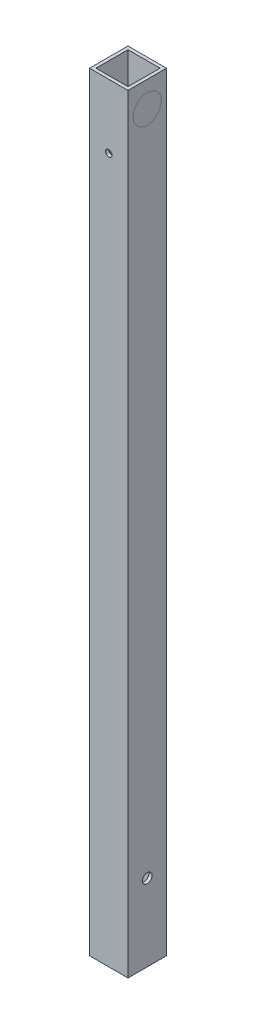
from build123d import *

# Parameters (mm, degrees)
TUBE_CONTOURS_W     = 38.1
TUBE_CONTOURS_H     = 38.1
TUBE_CONTOURS_W_2   = 31.75
TUBE_CONTOURS_H_2   = 31.75
BOSS_EXTRUDE1_DEPTH = 762
SKETCH4_R           = 4.7625
CUT_EXTRUDE1_DEPTH  = 764.189696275
SKETCH8_R           = 3.175
CUT_EXTRUDE2_DEPTH  = 764.189696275


with BuildPart() as part:
    # tube contours → Boss-Extrude1 (new body)
    with BuildSketch(Plane(origin=(0, 0, 0), x_dir=(1, 0, 0), z_dir=(0, 1, 0))):
        Rectangle(TUBE_CONTOURS_W, TUBE_CONTOURS_H)
        Rectangle(TUBE_CONTOURS_W_2, TUBE_CONTOURS_H_2, mode=Mode.SUBTRACT)
    extrude(amount=BOSS_EXTRUDE1_DEPTH)

    # Sketch4 → Cut-Extrude1 (cut, through all)
    with BuildSketch(Plane.ZY.offset(19.05)):
        with Locations((0, 76.2)):
            Circle(SKETCH4_R)
    extrude(amount=-CUT_EXTRUDE1_DEPTH, mode=Mode.SUBTRACT)

    # Sketch8 → Cut-Extrude2 (cut, through all)
    with BuildSketch(Plane(origin=(0, 0, -19.05), x_dir=(-1, 0, 0), z_dir=(0, 0, -1))):
        with Locations((0, 698.5)):
            Circle(SKETCH8_R)
    extrude(amount=-CUT_EXTRUDE2_DEPTH, mode=Mode.SUBTRACT)


solid = part.part
